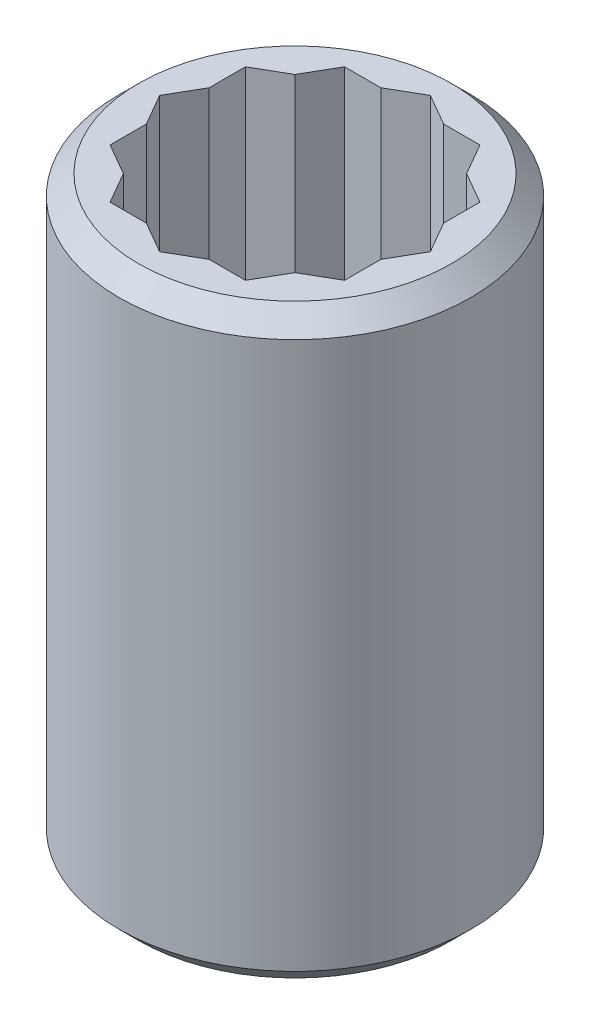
from build123d import *

# Parameters (mm, degrees)
SKETCH1_R        = 9
CYLINDER_DEPTH   = 30
F_6_POINT_DEPTH  = 15
F_12_POINT_DEPTH = 15
DRIVE_REACH      = 34.588
SKETCH4_W        = 6
SKETCH4_H        = 6
CHAMFER1_SIZE    = 1


with BuildPart() as part:
    # Sketch1 → Cylinder (new body)
    with BuildSketch(Plane(origin=(0, 0, 0), x_dir=(1, 0, 0), z_dir=(0, 1, 0))):
        with Locations(Location((0, 0, 0), (0, 0, 270))):
            Circle(SKETCH1_R)
    extrude(amount=CYLINDER_DEPTH)

    # Sketch2 → 6 Point (cut)
    with BuildSketch(Plane(origin=(0, 30, 0), x_dir=(-1, 0, 0), z_dir=(0, 1, 0))):
        Polygon((-6.92820323, 0), (-3.464101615, -6), (3.464101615, -6), (6.92820323, 0), (3.464101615, 6), (-3.464101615, 6), align=None)
    extrude(amount=-F_6_POINT_DEPTH, mode=Mode.SUBTRACT)

    # Sketch3 → 12 Point (cut)
    with BuildSketch(Plane(origin=(-3.872018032, 30, 9.384979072), x_dir=(-1, 0, 0), z_dir=(0, 1, 0))):
        Polygon((-9.872018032, -12.849080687), (-3.872018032, -16.313182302), (2.127981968, -12.849080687), (2.127981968, -5.920877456), (-3.872018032, -2.456775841), (-9.872018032, -5.920877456), align=None)
    extrude(amount=-F_12_POINT_DEPTH, mode=Mode.SUBTRACT)

    # Sketch4 → Drive (cut, up to next)
    with BuildSketch(Plane.XZ, mode=Mode.PRIVATE) as drive_sk1:
        Rectangle(SKETCH4_W, SKETCH4_H)
    drive_tool1 = extrude(drive_sk1.sketch, amount=-DRIVE_REACH, mode=Mode.PRIVATE) & part.part
    add(drive_tool1.solids().sort_by_distance((0, 0, 0))[0], mode=Mode.SUBTRACT)

    # Chamfer1
    chamfer1_edges = [part.edges().sort_by_distance(p)[0] for p in [
        (0, 0, -9),
        (0, 30, -9),
    ]]
    chamfer(chamfer1_edges, length=CHAMFER1_SIZE)


solid = part.part
